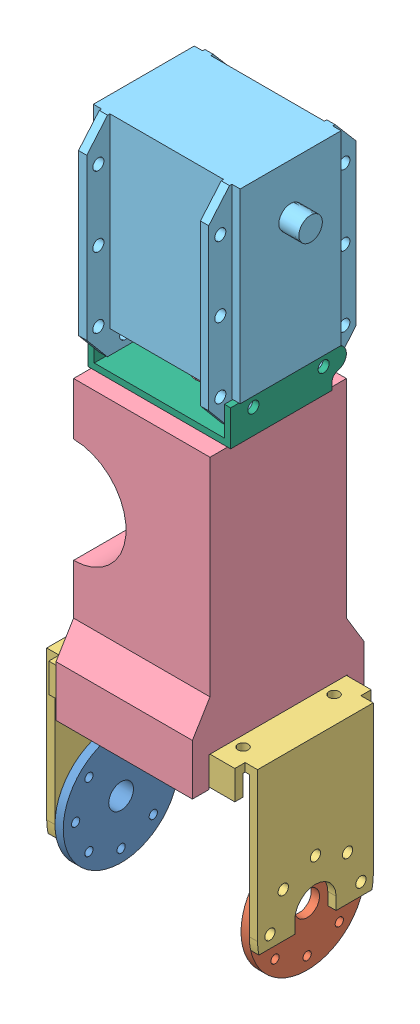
SolidWorks assembly X2.SLDASM, configuration Default (file format 16000). Lengths in mm.
Overall size (52 166 41.5).
6 component instances, 6 part files, 15 mates.
Components (placement in the parent):
- Disk_driver2-1: Disk_driver2.SLDPRT [Default] at origin size (5 28 28)
- Disk2-1: Disk2.SLDPRT [Default] at (45 0 0) size (2 28 28)
- Frame2-2: Frame2.SLDPRT [Default] at (21.5 0 0) size (51 39 33)
- Link1-1: Link1.SLDPRT [Default] at (21.5 73.1 0) x (0 1 0) z (-1 0 0) size (74.5 41.5 33)
- Actuator1-1: Actuator1.SLDPRT [Default] at (21.5 129.5 -1.7427) x (0 0 1) z (-1 0 0) size (35.6 50.6 45.2)
- Frame3-1: Frame3.SLDPRT [Default] at (38.75 98.2 -1.7427) x (0 1 0) z (0 0 1) size (8.6 34.5 28)
Mates (geometry in assembly coordinates):
- Concentric1: concentric: cylinder of Disk_driver2-1 through (0 0 0) axis (-1 0 0) radius 3; cylinder of Disk2-1 through (45 0 0) axis (-1 0 0) radius 3
- Concentric2: concentric: cylinder of Disk_driver2-1 through (-5 7.7782 7.7782) axis (1 0 0) radius 1; cylinder of Disk2-1 through (43 7.7782 7.7782) axis (1 0 0) radius 1
- Coincident1: coincident: plane of Disk_driver2-1 through (-2 3.75 0) normal (-1 0 0); plane of Frame2-2 through (-2 0 0) normal (1 0 0)
- Concentric3: concentric: cylinder of Disk_driver2-1 through (0 0 0) axis (-1 0 0) radius 3.75; cylinder of Frame2-2 through (-4 0 0) axis (1 0 0) radius 5
- Concentric4: concentric: cylinder of Disk_driver2-1 through (-5 0 -11) axis (1 0 0) radius 1; cylinder of Frame2-2 through (-4 0 -11) axis (-1 0 0) radius 1.25
- Coincident2: coincident: plane of Disk2-1 through (45 14 0) normal (1 0 0); plane of Frame2-2 through (45 0 0) normal (-1 0 0)
- Coincident3: coincident: plane of Frame2-2 through (-2 36 14) normal (0 1 0); plane of Link1-1 through (5 36 -16.75) normal (0 -1 0)
- Concentric5: concentric: cylinder of Frame2-2 through (21.5 36 0) axis (0 1 0) radius 5; cylinder of Link1-1 through (21.5 31 0) axis (0 1 0) radius 2.5
- Parallel1: parallel: plane of Frame2-2 through (21.5 0 -16.5) normal (0 0 -1); plane of Link1-1 through (5 28.7 -16.75) normal (0 0 1)
- Concentric6: concentric: cylinder of Link1-1 through (21.5 103.2 0) axis (0 -1 0) radius 2.5; cylinder of Frame3-1 through (21.5 106.8 0) axis (0 -1 0) radius 3.5
- Coincident5: coincident: plane of Link1-1 through (5 98.2 -16.5) normal (0 1 0); plane of Frame3-1 through (38.75 98.2 12.2573) normal (0 -1 0)
- Parallel2: parallel: plane of Link1-1 through (5 73.1 0) normal (-1 0 0); plane of Frame3-1 through (4.25 98.2 12.2573) normal (-1 0 0)
- Coincident7: coincident: plane of Actuator1-1 through (5.75 129.5 -1.7427) normal (-1 0 0); plane of Frame3-1 through (5.75 106.8 12.2573) normal (1 0 0)
- Concentric7: concentric: cylinder of Actuator1-1 through (7.75 104.2 -10.2427) axis (-1 0 0) radius 1.35; cylinder of Frame3-1 through (38.75 104.2 -10.2427) axis (-1 0 0) radius 1.35
- Concentric8: concentric: cylinder of Actuator1-1 through (7.75 104.2 6.7573) axis (-1 0 0) radius 1.35; cylinder of Frame3-1 through (38.75 104.2 6.7573) axis (-1 0 0) radius 1.35
